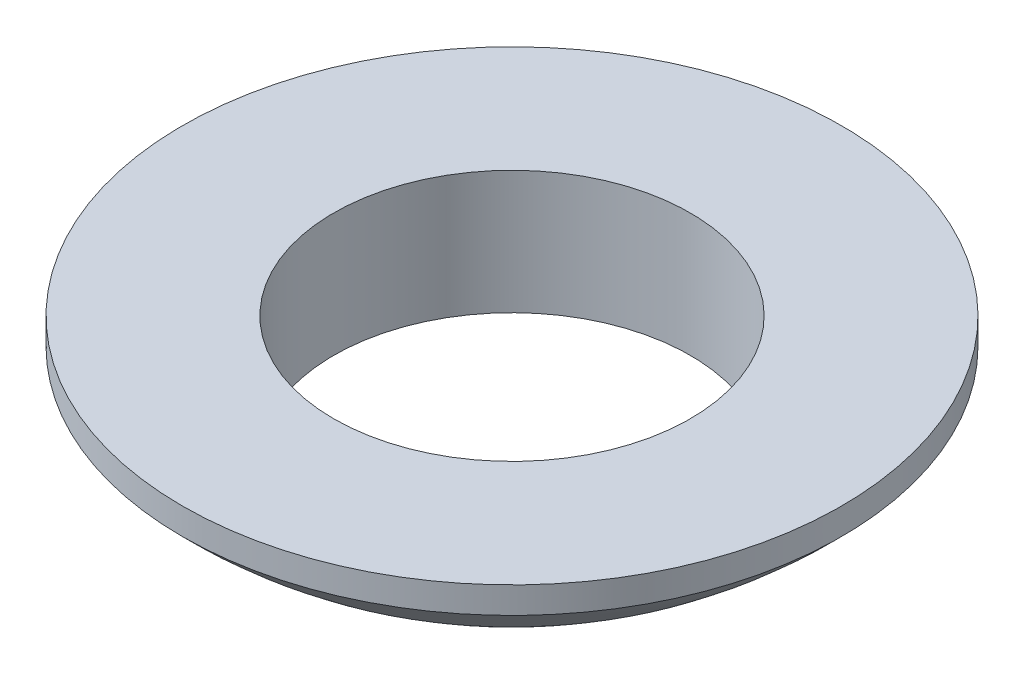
from build123d import *


with BuildPart() as part:
    # Esquisse2 → Base-R_volution (revolve)
    with BuildSketch(Plane.XY, mode=Mode.PRIVATE) as base_r_volution_sk:
        with BuildLine():
            Line((468.580237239, 263.508370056), (468.580237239, 267.908370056))
            Line((468.580237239, 267.908370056), (463.186211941, 267.908370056))
            Line((463.186211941, 267.908370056), (463.186211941, 266.963953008))
            ThreePointArc((463.186211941, 266.963953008), (465.424374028, 265.016787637), (467.978879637, 263.508370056))
            Line((467.978879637, 263.508370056), (468.580237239, 263.508370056))
        make_face()
    revolve(base_r_volution_sk.sketch.rotate(Axis((474.940237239, 265.578481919, 0), (0, -1, 0)), 270), axis=Axis((474.940237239, 265.578481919, 0), (0, -1, 0)))


solid = part.part
